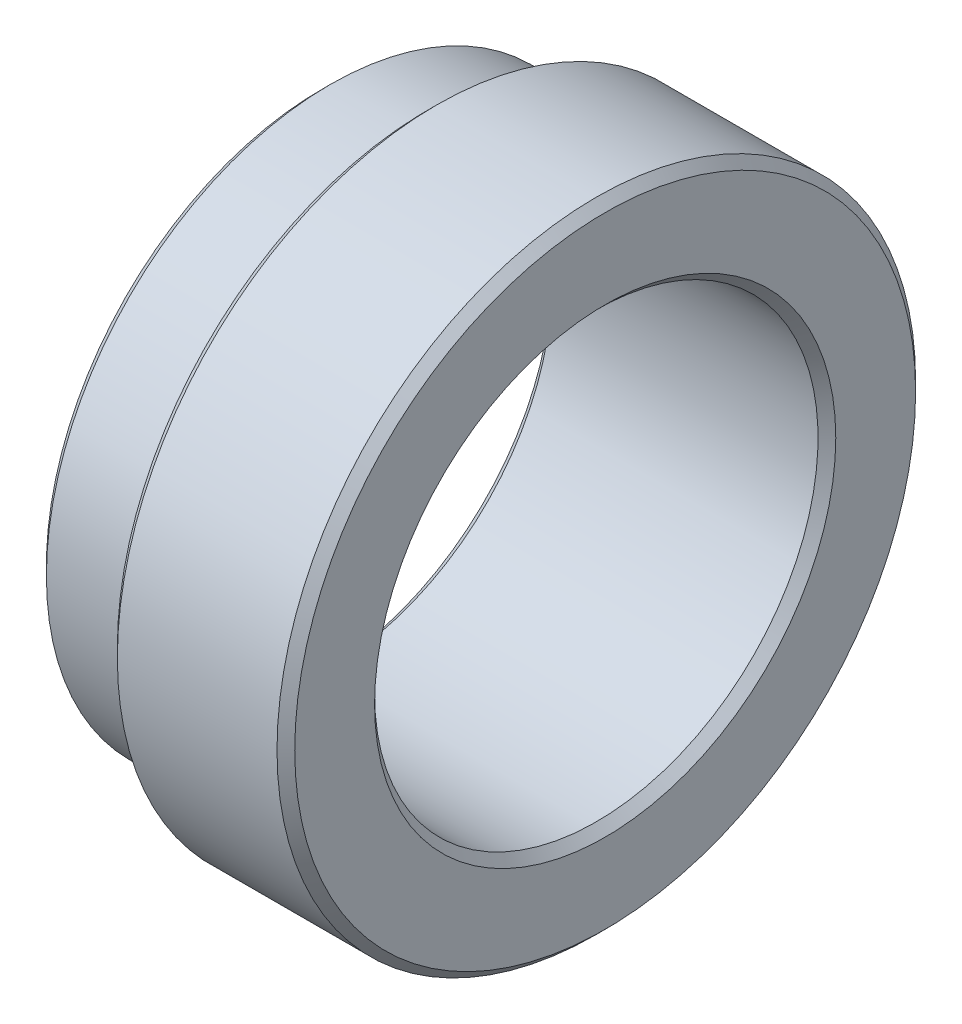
ISO-10303-21;
HEADER;
FILE_DESCRIPTION(('STEP AP214'),'2;1');
FILE_NAME('part.step','',(''),(''),'','','');
FILE_SCHEMA(('AUTOMOTIVE_DESIGN { 1 0 10303 214 1 1 1 1 }'));
ENDSEC;
DATA;
#1=APPLICATION_CONTEXT('core data for automotive mechanical design processes');
#2=APPLICATION_PROTOCOL_DEFINITION('international standard','automotive_design',2000,#1);
#3=PRODUCT_CONTEXT('',#1,'mechanical');
#4=PRODUCT('Part','Part','',(#3));
#5=PRODUCT_RELATED_PRODUCT_CATEGORY('part','',(#4));
#6=PRODUCT_DEFINITION_FORMATION('','',#4);
#7=PRODUCT_DEFINITION_CONTEXT('part definition',#1,'design');
#8=PRODUCT_DEFINITION('design','',#6,#7);
#9=PRODUCT_DEFINITION_SHAPE('','',#8);
#10=(LENGTH_UNIT() NAMED_UNIT(*) SI_UNIT(.MILLI.,.METRE.));
#11=(NAMED_UNIT(*) PLANE_ANGLE_UNIT() SI_UNIT($,.RADIAN.));
#12=(NAMED_UNIT(*) SI_UNIT($,.STERADIAN.) SOLID_ANGLE_UNIT());
#13=UNCERTAINTY_MEASURE_WITH_UNIT(LENGTH_MEASURE(1.E-05),#10,'distance_accuracy_value','');
#14=(GEOMETRIC_REPRESENTATION_CONTEXT(3) GLOBAL_UNCERTAINTY_ASSIGNED_CONTEXT((#13)) GLOBAL_UNIT_ASSIGNED_CONTEXT((#10,
#11,#12)) REPRESENTATION_CONTEXT('',''));
#15=CARTESIAN_POINT('',(0.,0.,0.));
#16=DIRECTION('',(0.,0.,1.));
#17=DIRECTION('',(1.,0.,0.));
#18=AXIS2_PLACEMENT_3D('',#15,#16,#17);
#19=CARTESIAN_POINT('',(0.,0.,-8.));
#20=DIRECTION('',(1.,0.,0.));
#21=DIRECTION('',(0.,0.,-1.));
#22=AXIS2_PLACEMENT_3D('',#19,#20,#21);
#23=PLANE('',#22);
#24=CARTESIAN_POINT('',(0.,0.,0.));
#25=DIRECTION('',(1.,0.,0.));
#26=DIRECTION('',(0.,0.,-1.));
#27=AXIS2_PLACEMENT_3D('',#24,#25,#26);
#28=CIRCLE('',#27,6.50000000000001);
#29=CARTESIAN_POINT('',(0.,0.,6.50000000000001));
#30=VERTEX_POINT('',#29);
#31=EDGE_CURVE('E57',#30,#30,#28,.T.);
#32=ORIENTED_EDGE('',*,*,#31,.T.);
#33=EDGE_LOOP('',(#32));
#34=FACE_BOUND('',#33,.T.);
#35=CARTESIAN_POINT('',(0.,0.,0.));
#36=DIRECTION('',(1.,0.,0.));
#37=DIRECTION('',(0.,0.,-1.));
#38=AXIS2_PLACEMENT_3D('',#35,#36,#37);
#39=CIRCLE('',#38,7.75);
#40=CARTESIAN_POINT('',(0.,0.,-7.75));
#41=VERTEX_POINT('',#40);
#42=EDGE_CURVE('E60',#41,#41,#39,.F.);
#43=ORIENTED_EDGE('',*,*,#42,.T.);
#44=EDGE_LOOP('',(#43));
#45=FACE_BOUND('',#44,.T.);
#46=ADVANCED_FACE('F31',(#34,#45),#23,.F.);
#47=CARTESIAN_POINT('',(0.,0.,0.));
#48=DIRECTION('',(-1.,0.,0.));
#49=DIRECTION('',(0.,0.,1.));
#50=AXIS2_PLACEMENT_3D('',#47,#48,#49);
#51=CYLINDRICAL_SURFACE('',#50,6.25);
#52=CARTESIAN_POINT('',(0.25000000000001,0.,0.));
#53=DIRECTION('',(1.,0.,0.));
#54=DIRECTION('',(0.,0.,-1.));
#55=AXIS2_PLACEMENT_3D('',#52,#53,#54);
#56=CIRCLE('',#55,6.25);
#57=CARTESIAN_POINT('',(0.25000000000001,0.,6.25));
#58=VERTEX_POINT('',#57);
#59=EDGE_CURVE('E63',#58,#58,#56,.F.);
#60=ORIENTED_EDGE('',*,*,#59,.T.);
#61=EDGE_LOOP('',(#60));
#62=FACE_BOUND('',#61,.T.);
#63=CARTESIAN_POINT('',(7.75,0.,0.));
#64=DIRECTION('',(-1.,0.,0.));
#65=DIRECTION('',(0.,0.,1.));
#66=AXIS2_PLACEMENT_3D('',#63,#64,#65);
#67=CIRCLE('',#66,6.25);
#68=CARTESIAN_POINT('',(7.75,0.,6.25));
#69=VERTEX_POINT('',#68);
#70=EDGE_CURVE('E66',#69,#69,#67,.F.);
#71=ORIENTED_EDGE('',*,*,#70,.T.);
#72=EDGE_LOOP('',(#71));
#73=FACE_BOUND('',#72,.T.);
#74=ADVANCED_FACE('F91',(#62,#73),#51,.F.);
#75=CARTESIAN_POINT('',(8.,0.,-6.25));
#76=DIRECTION('',(-1.,0.,0.));
#77=DIRECTION('',(0.,0.,1.));
#78=AXIS2_PLACEMENT_3D('',#75,#76,#77);
#79=PLANE('',#78);
#80=CARTESIAN_POINT('',(8.,0.,0.));
#81=DIRECTION('',(-1.,0.,0.));
#82=DIRECTION('',(0.,0.,1.));
#83=AXIS2_PLACEMENT_3D('',#80,#81,#82);
#84=CIRCLE('',#83,6.5);
#85=CARTESIAN_POINT('',(8.,0.,6.5));
#86=VERTEX_POINT('',#85);
#87=EDGE_CURVE('E10',#86,#86,#84,.T.);
#88=ORIENTED_EDGE('',*,*,#87,.T.);
#89=EDGE_LOOP('',(#88));
#90=FACE_BOUND('',#89,.T.);
#91=CARTESIAN_POINT('',(8.,0.,0.));
#92=DIRECTION('',(-1.,0.,0.));
#93=DIRECTION('',(0.,0.,1.));
#94=AXIS2_PLACEMENT_3D('',#91,#92,#93);
#95=CIRCLE('',#94,8.74999999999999);
#96=CARTESIAN_POINT('',(8.,0.,8.74999999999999));
#97=VERTEX_POINT('',#96);
#98=EDGE_CURVE('E38',#97,#97,#95,.F.);
#99=ORIENTED_EDGE('',*,*,#98,.T.);
#100=EDGE_LOOP('',(#99));
#101=FACE_BOUND('',#100,.T.);
#102=ADVANCED_FACE('F87',(#90,#101),#79,.F.);
#103=CARTESIAN_POINT('',(0.,0.,0.));
#104=DIRECTION('',(-1.,0.,0.));
#105=DIRECTION('',(0.,0.,1.));
#106=AXIS2_PLACEMENT_3D('',#103,#104,#105);
#107=CYLINDRICAL_SURFACE('',#106,8.99999999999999);
#108=CARTESIAN_POINT('',(3.25000000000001,0.,0.));
#109=DIRECTION('',(1.,0.,0.));
#110=DIRECTION('',(0.,0.,-1.));
#111=AXIS2_PLACEMENT_3D('',#108,#109,#110);
#112=CIRCLE('',#111,8.99999999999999);
#113=CARTESIAN_POINT('',(3.25000000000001,0.,-8.99999999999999));
#114=VERTEX_POINT('',#113);
#115=EDGE_CURVE('E42',#114,#114,#112,.T.);
#116=ORIENTED_EDGE('',*,*,#115,.T.);
#117=EDGE_LOOP('',(#116));
#118=FACE_BOUND('',#117,.T.);
#119=CARTESIAN_POINT('',(7.75,0.,0.));
#120=DIRECTION('',(-1.,0.,0.));
#121=DIRECTION('',(0.,0.,1.));
#122=AXIS2_PLACEMENT_3D('',#119,#120,#121);
#123=CIRCLE('',#122,8.99999999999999);
#124=CARTESIAN_POINT('',(7.75,0.,8.99999999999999));
#125=VERTEX_POINT('',#124);
#126=EDGE_CURVE('E46',#125,#125,#123,.T.);
#127=ORIENTED_EDGE('',*,*,#126,.T.);
#128=EDGE_LOOP('',(#127));
#129=FACE_BOUND('',#128,.T.);
#130=ADVANCED_FACE('F77',(#118,#129),#107,.T.);
#131=CARTESIAN_POINT('',(3.,0.,-8.99999999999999));
#132=DIRECTION('',(1.,0.,0.));
#133=DIRECTION('',(0.,0.,-1.));
#134=AXIS2_PLACEMENT_3D('',#131,#132,#133);
#135=PLANE('',#134);
#136=CARTESIAN_POINT('',(3.,0.,0.));
#137=DIRECTION('',(1.,0.,0.));
#138=DIRECTION('',(0.,0.,-1.));
#139=AXIS2_PLACEMENT_3D('',#136,#137,#138);
#140=CIRCLE('',#139,8.74999999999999);
#141=CARTESIAN_POINT('',(3.,0.,-8.74999999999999));
#142=VERTEX_POINT('',#141);
#143=EDGE_CURVE('E51',#142,#142,#140,.F.);
#144=ORIENTED_EDGE('',*,*,#143,.T.);
#145=EDGE_LOOP('',(#144));
#146=FACE_BOUND('',#145,.T.);
#147=CARTESIAN_POINT('',(3.,0.,0.));
#148=DIRECTION('',(-1.,0.,0.));
#149=DIRECTION('',(0.,0.,1.));
#150=AXIS2_PLACEMENT_3D('',#147,#148,#149);
#151=CIRCLE('',#150,8.);
#152=CARTESIAN_POINT('',(3.,0.,8.));
#153=VERTEX_POINT('',#152);
#154=EDGE_CURVE('E69',#153,#153,#151,.T.);
#155=ORIENTED_EDGE('',*,*,#154,.F.);
#156=EDGE_LOOP('',(#155));
#157=FACE_BOUND('',#156,.T.);
#158=ADVANCED_FACE('F75',(#146,#157),#135,.F.);
#159=CARTESIAN_POINT('',(0.,0.,0.));
#160=DIRECTION('',(-1.,0.,0.));
#161=DIRECTION('',(0.,0.,1.));
#162=AXIS2_PLACEMENT_3D('',#159,#160,#161);
#163=CYLINDRICAL_SURFACE('',#162,8.);
#164=CARTESIAN_POINT('',(0.250000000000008,0.,0.));
#165=DIRECTION('',(1.,0.,0.));
#166=DIRECTION('',(0.,0.,-1.));
#167=AXIS2_PLACEMENT_3D('',#164,#165,#166);
#168=CIRCLE('',#167,8.);
#169=CARTESIAN_POINT('',(0.250000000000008,0.,-8.));
#170=VERTEX_POINT('',#169);
#171=EDGE_CURVE('E54',#170,#170,#168,.T.);
#172=ORIENTED_EDGE('',*,*,#171,.T.);
#173=EDGE_LOOP('',(#172));
#174=FACE_BOUND('',#173,.T.);
#175=ORIENTED_EDGE('',*,*,#154,.T.);
#176=EDGE_LOOP('',(#175));
#177=FACE_BOUND('',#176,.T.);
#178=ADVANCED_FACE('F73',(#174,#177),#163,.T.);
#179=CARTESIAN_POINT('',(0.25000000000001,0.,0.));
#180=DIRECTION('',(-1.,0.,0.));
#181=DIRECTION('',(0.,0.,1.));
#182=AXIS2_PLACEMENT_3D('',#179,#180,#181);
#183=CONICAL_SURFACE('',#182,6.25,0.785398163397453);
#184=CARTESIAN_POINT('',(0.,0.,6.50000000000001));
#185=CARTESIAN_POINT('',(0.00260416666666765,0.,6.49739583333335));
#186=CARTESIAN_POINT('',(0.00520833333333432,0.,6.49479166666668));
#187=CARTESIAN_POINT('',(0.0104166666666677,0.,6.48958333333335));
#188=CARTESIAN_POINT('',(0.0130208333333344,0.,6.48697916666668));
#189=CARTESIAN_POINT('',(0.018229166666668,0.,6.48177083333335));
#190=CARTESIAN_POINT('',(0.0208333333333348,0.,6.47916666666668));
#191=CARTESIAN_POINT('',(0.0260416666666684,0.,6.47395833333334));
#192=CARTESIAN_POINT('',(0.028645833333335,0.,6.47135416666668));
#193=CARTESIAN_POINT('',(0.0338541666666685,0.,6.46614583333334));
#194=CARTESIAN_POINT('',(0.0364583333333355,0.,6.46354166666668));
#195=CARTESIAN_POINT('',(0.041666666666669,0.,6.45833333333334));
#196=CARTESIAN_POINT('',(0.0442708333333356,0.,6.45572916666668));
#197=CARTESIAN_POINT('',(0.0494791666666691,0.,6.45052083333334));
#198=CARTESIAN_POINT('',(0.0520833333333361,0.,6.44791666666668));
#199=CARTESIAN_POINT('',(0.0572916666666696,0.,6.44270833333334));
#200=CARTESIAN_POINT('',(0.0598958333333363,0.,6.44010416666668));
#201=CARTESIAN_POINT('',(0.0651041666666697,0.,6.43489583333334));
#202=CARTESIAN_POINT('',(0.0677083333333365,0.,6.43229166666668));
#203=CARTESIAN_POINT('',(0.0729166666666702,0.,6.42708333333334));
#204=CARTESIAN_POINT('',(0.075520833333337,0.,6.42447916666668));
#205=CARTESIAN_POINT('',(0.0807291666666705,0.,6.41927083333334));
#206=CARTESIAN_POINT('',(0.0833333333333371,0.,6.41666666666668));
#207=CARTESIAN_POINT('',(0.0885416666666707,0.,6.41145833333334));
#208=CARTESIAN_POINT('',(0.0911458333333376,0.,6.40885416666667));
#209=CARTESIAN_POINT('',(0.0963541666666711,0.,6.40364583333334));
#210=CARTESIAN_POINT('',(0.0989583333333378,0.,6.40104166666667));
#211=CARTESIAN_POINT('',(0.104166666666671,0.,6.39583333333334));
#212=CARTESIAN_POINT('',(0.106770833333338,0.,6.39322916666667));
#213=CARTESIAN_POINT('',(0.111979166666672,0.,6.38802083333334));
#214=CARTESIAN_POINT('',(0.114583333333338,0.,6.38541666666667));
#215=CARTESIAN_POINT('',(0.119791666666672,0.,6.38020833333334));
#216=CARTESIAN_POINT('',(0.122395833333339,0.,6.37760416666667));
#217=CARTESIAN_POINT('',(0.127604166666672,0.,6.37239583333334));
#218=CARTESIAN_POINT('',(0.130208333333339,0.,6.36979166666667));
#219=CARTESIAN_POINT('',(0.135416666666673,0.,6.36458333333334));
#220=CARTESIAN_POINT('',(0.138020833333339,0.,6.36197916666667));
#221=CARTESIAN_POINT('',(0.143229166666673,0.,6.35677083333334));
#222=CARTESIAN_POINT('',(0.14583333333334,0.,6.35416666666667));
#223=CARTESIAN_POINT('',(0.151041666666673,0.,6.34895833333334));
#224=CARTESIAN_POINT('',(0.15364583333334,0.,6.34635416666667));
#225=CARTESIAN_POINT('',(0.158854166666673,0.,6.34114583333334));
#226=CARTESIAN_POINT('',(0.16145833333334,0.,6.33854166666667));
#227=CARTESIAN_POINT('',(0.166666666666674,0.,6.33333333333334));
#228=CARTESIAN_POINT('',(0.169270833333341,0.,6.33072916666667));
#229=CARTESIAN_POINT('',(0.174479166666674,0.,6.32552083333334));
#230=CARTESIAN_POINT('',(0.177083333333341,0.,6.32291666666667));
#231=CARTESIAN_POINT('',(0.182291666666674,0.,6.31770833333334));
#232=CARTESIAN_POINT('',(0.184895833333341,0.,6.31510416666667));
#233=CARTESIAN_POINT('',(0.190104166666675,0.,6.30989583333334));
#234=CARTESIAN_POINT('',(0.192708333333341,0.,6.30729166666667));
#235=CARTESIAN_POINT('',(0.197916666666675,0.,6.30208333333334));
#236=CARTESIAN_POINT('',(0.200520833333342,0.,6.29947916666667));
#237=CARTESIAN_POINT('',(0.205729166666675,0.,6.29427083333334));
#238=CARTESIAN_POINT('',(0.208333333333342,0.,6.29166666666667));
#239=CARTESIAN_POINT('',(0.213541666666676,0.,6.28645833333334));
#240=CARTESIAN_POINT('',(0.216145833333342,0.,6.28385416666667));
#241=CARTESIAN_POINT('',(0.221354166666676,0.,6.27864583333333));
#242=CARTESIAN_POINT('',(0.223958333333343,0.,6.27604166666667));
#243=CARTESIAN_POINT('',(0.229166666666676,0.,6.27083333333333));
#244=CARTESIAN_POINT('',(0.231770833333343,0.,6.26822916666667));
#245=CARTESIAN_POINT('',(0.236979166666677,0.,6.26302083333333));
#246=CARTESIAN_POINT('',(0.239583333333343,0.,6.26041666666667));
#247=CARTESIAN_POINT('',(0.244791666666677,0.,6.25520833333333));
#248=CARTESIAN_POINT('',(0.247395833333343,0.,6.25260416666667));
#249=CARTESIAN_POINT('',(0.25000000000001,0.,6.25));
#250=B_SPLINE_CURVE_WITH_KNOTS('',3,(#184,#185,#186,#187,#188,#189,#190,#191,#192,#193,#194,
#195,#196,#197,#198,#199,#200,#201,#202,#203,#204,#205,#206,#207,#208,#209,#210,#211,#212,#213,
#214,#215,#216,#217,#218,#219,#220,#221,#222,#223,#224,#225,#226,#227,#228,#229,#230,#231,#232,
#233,#234,#235,#236,#237,#238,#239,#240,#241,#242,#243,#244,#245,#246,#247,#248,#249),
.UNSPECIFIED.,.F.,.F.,(4,2,2,2,2,2,2,2,2,2,2,2,2,2,2,2,2,2,2,2,2,2,2,2,2,2,2,2,2,2,2,2,4),(0.,
0.01104854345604,0.0220970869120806,0.0331456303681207,0.0441941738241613,0.0552427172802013,
0.066291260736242,0.077339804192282,0.0883883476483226,0.0994368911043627,0.110485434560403,
0.121533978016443,0.132582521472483,0.143631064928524,0.154679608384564,0.165728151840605,
0.176776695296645,0.187825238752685,0.198873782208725,0.209922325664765,0.220970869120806,
0.232019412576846,0.243067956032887,0.254116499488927,0.265165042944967,0.276213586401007,
0.287262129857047,0.298310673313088,0.309359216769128,0.320407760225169,0.331456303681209,
0.342504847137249,0.353553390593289),.UNSPECIFIED.);
#251=EDGE_CURVE('BSEAM84',#30,#58,#250,.T.);
#252=ORIENTED_EDGE('',*,*,#31,.F.);
#253=ORIENTED_EDGE('',*,*,#59,.F.);
#254=ORIENTED_EDGE('',*,*,#251,.T.);
#255=ORIENTED_EDGE('',*,*,#251,.F.);
#256=EDGE_LOOP('',(#252,#254,#253,#255));
#257=FACE_BOUND('',#256,.T.);
#258=ADVANCED_FACE('F84',(#257),#183,.F.);
#259=CARTESIAN_POINT('',(0.,0.,0.));
#260=DIRECTION('',(1.,0.,0.));
#261=DIRECTION('',(0.,0.,-1.));
#262=AXIS2_PLACEMENT_3D('',#259,#260,#261);
#263=CONICAL_SURFACE('',#262,7.75,0.785398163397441);
#264=ORIENTED_EDGE('',*,*,#171,.F.);
#265=EDGE_LOOP('',(#264));
#266=FACE_BOUND('',#265,.T.);
#267=ORIENTED_EDGE('',*,*,#42,.F.);
#268=EDGE_LOOP('',(#267));
#269=FACE_BOUND('',#268,.T.);
#270=ADVANCED_FACE('F104',(#266,#269),#263,.T.);
#271=CARTESIAN_POINT('',(3.,0.,0.));
#272=DIRECTION('',(1.,0.,0.));
#273=DIRECTION('',(0.,0.,-1.));
#274=AXIS2_PLACEMENT_3D('',#271,#272,#273);
#275=CONICAL_SURFACE('',#274,8.74999999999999,0.785398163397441);
#276=ORIENTED_EDGE('',*,*,#115,.F.);
#277=EDGE_LOOP('',(#276));
#278=FACE_BOUND('',#277,.T.);
#279=ORIENTED_EDGE('',*,*,#143,.F.);
#280=EDGE_LOOP('',(#279));
#281=FACE_BOUND('',#280,.T.);
#282=ADVANCED_FACE('F108',(#278,#281),#275,.T.);
#283=CARTESIAN_POINT('',(8.,0.,0.));
#284=DIRECTION('',(1.,0.,0.));
#285=DIRECTION('',(0.,0.,-1.));
#286=AXIS2_PLACEMENT_3D('',#283,#284,#285);
#287=CONICAL_SURFACE('',#286,6.5,0.785398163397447);
#288=ORIENTED_EDGE('',*,*,#70,.F.);
#289=EDGE_LOOP('',(#288));
#290=FACE_BOUND('',#289,.T.);
#291=ORIENTED_EDGE('',*,*,#87,.F.);
#292=EDGE_LOOP('',(#291));
#293=FACE_BOUND('',#292,.T.);
#294=ADVANCED_FACE('F111',(#290,#293),#287,.F.);
#295=CARTESIAN_POINT('',(7.75,0.,0.));
#296=DIRECTION('',(-1.,0.,0.));
#297=DIRECTION('',(0.,0.,1.));
#298=AXIS2_PLACEMENT_3D('',#295,#296,#297);
#299=CONICAL_SURFACE('',#298,8.99999999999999,0.785398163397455);
#300=ORIENTED_EDGE('',*,*,#98,.F.);
#301=EDGE_LOOP('',(#300));
#302=FACE_BOUND('',#301,.T.);
#303=ORIENTED_EDGE('',*,*,#126,.F.);
#304=EDGE_LOOP('',(#303));
#305=FACE_BOUND('',#304,.T.);
#306=ADVANCED_FACE('F33',(#302,#305),#299,.T.);
#307=CLOSED_SHELL('',(#46,#74,#102,#130,#158,#178,#258,#270,#282,#294,#306));
#308=MANIFOLD_SOLID_BREP('B2',#307);
#309=ADVANCED_BREP_SHAPE_REPRESENTATION('',(#18,#308),#14);
#310=SHAPE_DEFINITION_REPRESENTATION(#9,#309);
ENDSEC;
END-ISO-10303-21;
